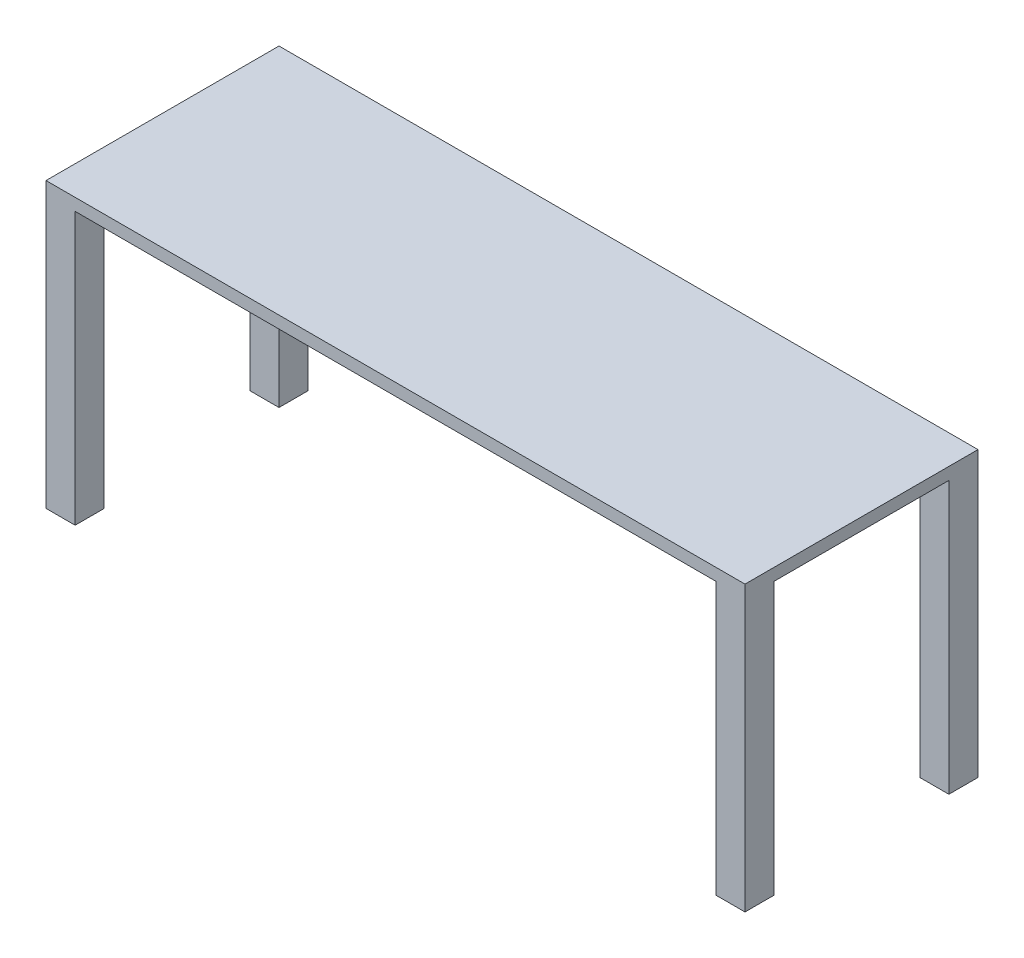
from build123d import *

# Parameters (mm, degrees)
SKETCH1_W           = 1828.8
SKETCH1_H           = 609.6
BOSS_EXTRUDE1_DEPTH = 31.75
SKETCH2_W           = 76.2
SKETCH2_H           = 76.2
BOSS_EXTRUDE2_DEPTH = 711.2


with BuildPart() as part:
    # Sketch1 → Boss-Extrude1 (new body)
    with BuildSketch(Plane(origin=(0, 0, 0), x_dir=(1, 0, 0), z_dir=(0, 1, 0))):
        with Locations((914.4, 304.8)):
            Rectangle(SKETCH1_W, SKETCH1_H)
    extrude(amount=BOSS_EXTRUDE1_DEPTH)

    # Sketch2 → Boss-Extrude2 (add)
    with BuildSketch(Plane.XZ):
        with Locations((38.1, -38.1)):
            Rectangle(SKETCH2_W, SKETCH2_H)
        with Locations((38.1, -571.5)):
            Rectangle(SKETCH2_W, SKETCH2_H)
        with Locations((1790.7, -571.5)):
            Rectangle(SKETCH2_W, SKETCH2_H)
        with Locations((1790.7, -38.1)):
            Rectangle(SKETCH2_W, SKETCH2_H)
    extrude(amount=BOSS_EXTRUDE2_DEPTH)


solid = part.part
